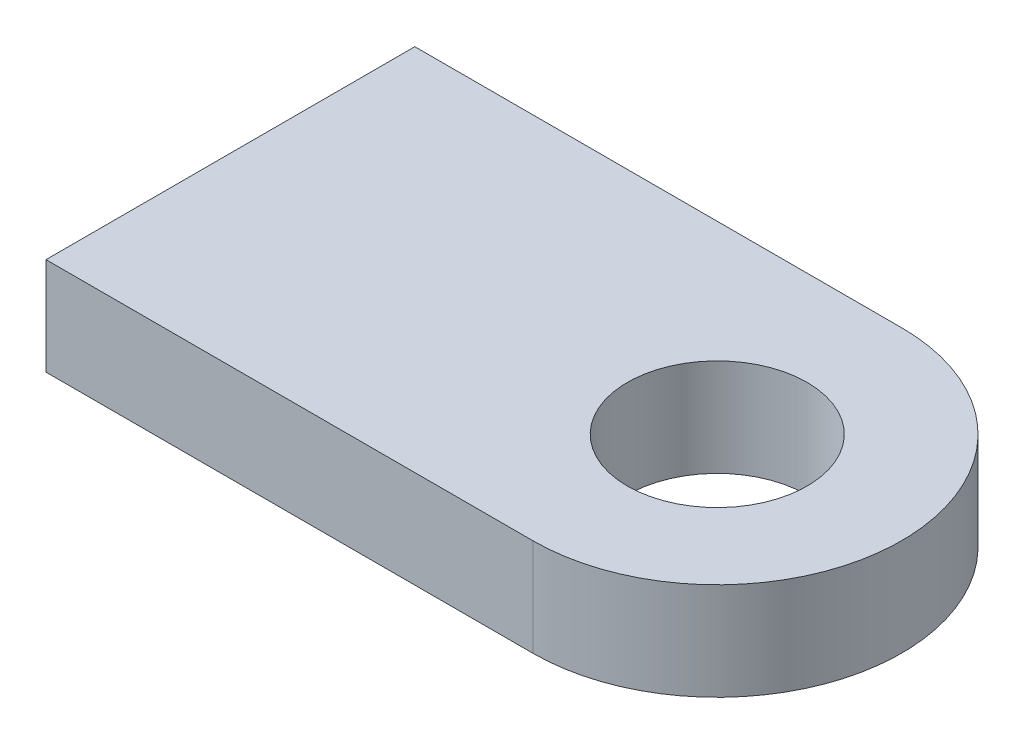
from build123d import *

# Parameters (mm, degrees)
SKETCH1_R      = 18.441162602
EXTRUDE1_DEPTH = 20


with BuildPart() as part:
    # Sketch1 → Extrude1 (new body)
    with BuildSketch(Plane(origin=(0, 0, 0), x_dir=(1, 0, 0), z_dir=(0, 1, 0))):
        with BuildLine():
            Line((-99.900651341, -37.846321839), (-99.900651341, 37.846321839))
            Line((-99.900651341, 37.846321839), (0, 37.846321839))
            ThreePointArc((0, 37.846321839), (37.846321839, 0), (0, -37.846321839))
            Line((0, -37.846321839), (-99.900651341, -37.846321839))
        make_face()
        with Locations(Location((0, 0, 0), (0, 0, 270))):
            Circle(SKETCH1_R, mode=Mode.SUBTRACT)
    extrude(amount=EXTRUDE1_DEPTH)


solid = part.part
